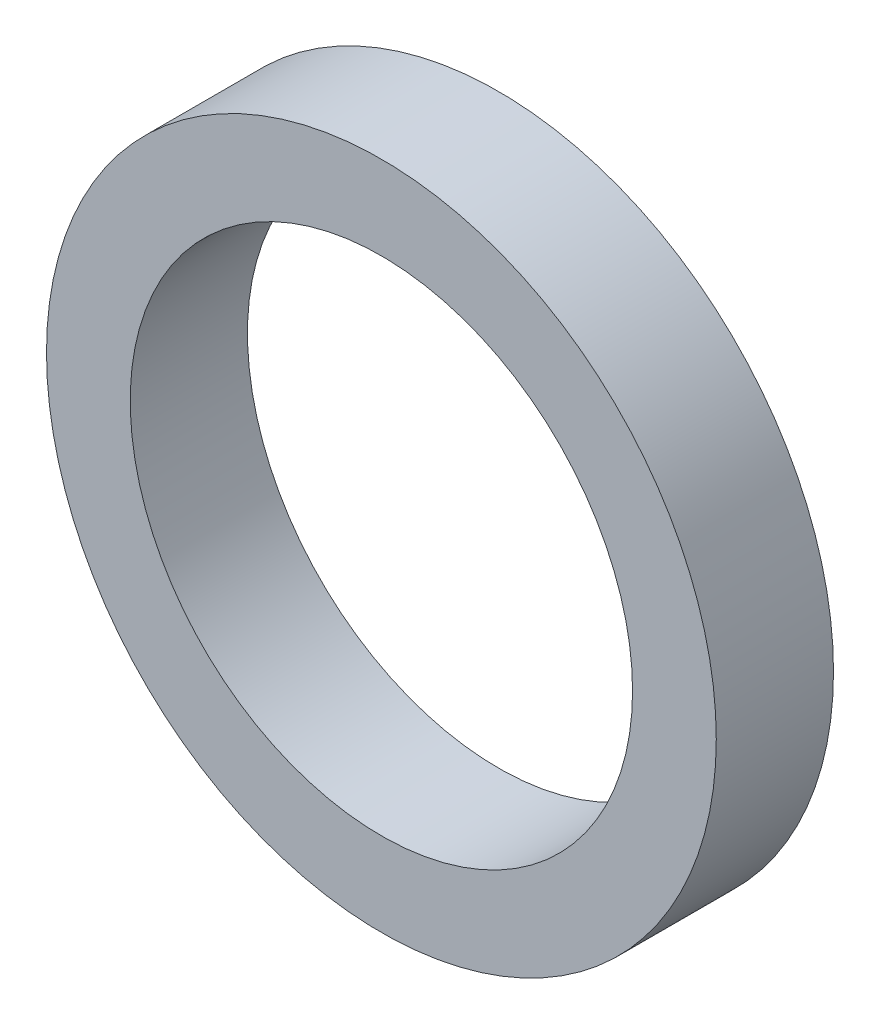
ISO-10303-21;
HEADER;
FILE_DESCRIPTION(('STEP AP214'),'2;1');
FILE_NAME('part.step','',(''),(''),'','','');
FILE_SCHEMA(('AUTOMOTIVE_DESIGN { 1 0 10303 214 1 1 1 1 }'));
ENDSEC;
DATA;
#1=APPLICATION_CONTEXT('core data for automotive mechanical design processes');
#2=APPLICATION_PROTOCOL_DEFINITION('international standard','automotive_design',2000,#1);
#3=PRODUCT_CONTEXT('',#1,'mechanical');
#4=PRODUCT('Part','Part','',(#3));
#5=PRODUCT_RELATED_PRODUCT_CATEGORY('part','',(#4));
#6=PRODUCT_DEFINITION_FORMATION('','',#4);
#7=PRODUCT_DEFINITION_CONTEXT('part definition',#1,'design');
#8=PRODUCT_DEFINITION('design','',#6,#7);
#9=PRODUCT_DEFINITION_SHAPE('','',#8);
#10=(LENGTH_UNIT() NAMED_UNIT(*) SI_UNIT(.MILLI.,.METRE.));
#11=(NAMED_UNIT(*) PLANE_ANGLE_UNIT() SI_UNIT($,.RADIAN.));
#12=(NAMED_UNIT(*) SI_UNIT($,.STERADIAN.) SOLID_ANGLE_UNIT());
#13=UNCERTAINTY_MEASURE_WITH_UNIT(LENGTH_MEASURE(1.E-05),#10,'distance_accuracy_value','');
#14=(GEOMETRIC_REPRESENTATION_CONTEXT(3) GLOBAL_UNCERTAINTY_ASSIGNED_CONTEXT((#13)) GLOBAL_UNIT_ASSIGNED_CONTEXT((#10,
#11,#12)) REPRESENTATION_CONTEXT('',''));
#15=CARTESIAN_POINT('',(0.,0.,0.));
#16=DIRECTION('',(0.,0.,1.));
#17=DIRECTION('',(1.,0.,0.));
#18=AXIS2_PLACEMENT_3D('',#15,#16,#17);
#19=CARTESIAN_POINT('',(0.,0.,7.));
#20=DIRECTION('',(0.,0.,1.));
#21=DIRECTION('',(1.,0.,0.));
#22=AXIS2_PLACEMENT_3D('',#19,#20,#21);
#23=PLANE('',#22);
#24=CARTESIAN_POINT('',(0.,0.,7.));
#25=DIRECTION('',(0.,0.,1.));
#26=DIRECTION('',(1.,0.,0.));
#27=AXIS2_PLACEMENT_3D('',#24,#25,#26);
#28=CIRCLE('',#27,20.);
#29=CARTESIAN_POINT('',(20.,0.,7.));
#30=VERTEX_POINT('',#29);
#31=EDGE_CURVE('E10',#30,#30,#28,.T.);
#32=ORIENTED_EDGE('',*,*,#31,.T.);
#33=EDGE_LOOP('',(#32));
#34=FACE_BOUND('',#33,.T.);
#35=CARTESIAN_POINT('',(0.,0.,7.));
#36=DIRECTION('',(0.,0.,1.));
#37=DIRECTION('',(1.,0.,0.));
#38=AXIS2_PLACEMENT_3D('',#35,#36,#37);
#39=CIRCLE('',#38,15.);
#40=CARTESIAN_POINT('',(15.,0.,7.));
#41=VERTEX_POINT('',#40);
#42=EDGE_CURVE('E31',#41,#41,#39,.T.);
#43=ORIENTED_EDGE('',*,*,#42,.F.);
#44=EDGE_LOOP('',(#43));
#45=FACE_BOUND('',#44,.T.);
#46=ADVANCED_FACE('F20',(#34,#45),#23,.T.);
#47=CARTESIAN_POINT('',(0.,0.,0.));
#48=DIRECTION('',(0.,0.,1.));
#49=DIRECTION('',(1.,0.,0.));
#50=AXIS2_PLACEMENT_3D('',#47,#48,#49);
#51=PLANE('',#50);
#52=CARTESIAN_POINT('',(0.,0.,0.));
#53=DIRECTION('',(0.,0.,1.));
#54=DIRECTION('',(1.,0.,0.));
#55=AXIS2_PLACEMENT_3D('',#52,#53,#54);
#56=CIRCLE('',#55,20.);
#57=CARTESIAN_POINT('',(20.,0.,0.));
#58=VERTEX_POINT('',#57);
#59=EDGE_CURVE('E27',#58,#58,#56,.T.);
#60=ORIENTED_EDGE('',*,*,#59,.F.);
#61=EDGE_LOOP('',(#60));
#62=FACE_BOUND('',#61,.T.);
#63=CARTESIAN_POINT('',(0.,0.,0.));
#64=DIRECTION('',(0.,0.,1.));
#65=DIRECTION('',(1.,0.,0.));
#66=AXIS2_PLACEMENT_3D('',#63,#64,#65);
#67=CIRCLE('',#66,15.);
#68=CARTESIAN_POINT('',(15.,0.,0.));
#69=VERTEX_POINT('',#68);
#70=EDGE_CURVE('E35',#69,#69,#67,.T.);
#71=ORIENTED_EDGE('',*,*,#70,.T.);
#72=EDGE_LOOP('',(#71));
#73=FACE_BOUND('',#72,.T.);
#74=ADVANCED_FACE('F41',(#62,#73),#51,.F.);
#75=CARTESIAN_POINT('',(0.,0.,7.));
#76=DIRECTION('',(0.,0.,-1.));
#77=DIRECTION('',(-1.,0.,0.));
#78=AXIS2_PLACEMENT_3D('',#75,#76,#77);
#79=CYLINDRICAL_SURFACE('',#78,20.);
#80=ORIENTED_EDGE('',*,*,#31,.F.);
#81=EDGE_LOOP('',(#80));
#82=FACE_BOUND('',#81,.T.);
#83=ORIENTED_EDGE('',*,*,#59,.T.);
#84=EDGE_LOOP('',(#83));
#85=FACE_BOUND('',#84,.T.);
#86=ADVANCED_FACE('F22',(#82,#85),#79,.T.);
#87=CARTESIAN_POINT('',(0.,0.,7.));
#88=DIRECTION('',(0.,0.,-1.));
#89=DIRECTION('',(-1.,0.,0.));
#90=AXIS2_PLACEMENT_3D('',#87,#88,#89);
#91=CYLINDRICAL_SURFACE('',#90,15.);
#92=ORIENTED_EDGE('',*,*,#42,.T.);
#93=EDGE_LOOP('',(#92));
#94=FACE_BOUND('',#93,.T.);
#95=ORIENTED_EDGE('',*,*,#70,.F.);
#96=EDGE_LOOP('',(#95));
#97=FACE_BOUND('',#96,.T.);
#98=ADVANCED_FACE('F43',(#94,#97),#91,.F.);
#99=CLOSED_SHELL('',(#46,#74,#86,#98));
#100=MANIFOLD_SOLID_BREP('B2',#99);
#101=ADVANCED_BREP_SHAPE_REPRESENTATION('',(#18,#100),#14);
#102=SHAPE_DEFINITION_REPRESENTATION(#9,#101);
ENDSEC;
END-ISO-10303-21;
